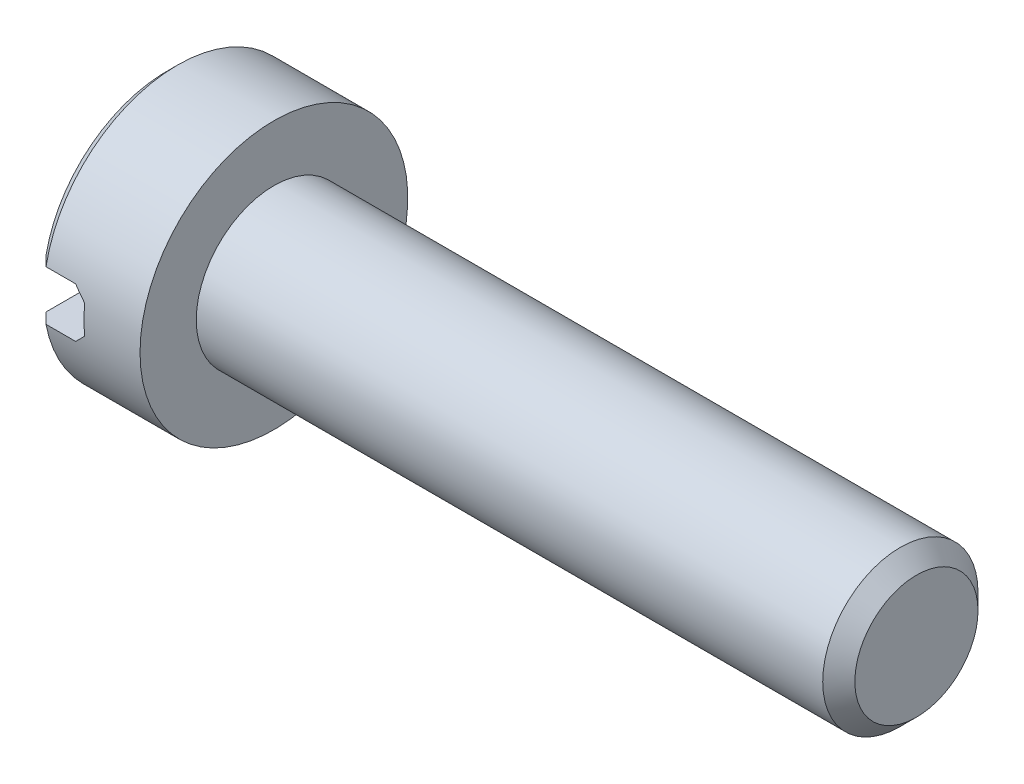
from build123d import *

# Parameters (mm, degrees)
ENL_V_MAT_EXTRU_1_DEPTH = 5
ESQUISSE3_R             = 1.45
EXTRUSION1_DEPTH        = 12
CHANFREIN1_SIZE         = 0.3


with BuildPart() as part:
    # Esquisse1 → R_volution1 (revolve)
    with BuildSketch(Plane.XY, mode=Mode.PRIVATE) as r_volution1_sk:
        Polygon((0, 0), (0, 2.3), (0.2, 2.5), (2, 2.5), (2, 0), align=None)
    revolve(r_volution1_sk.sketch.rotate(Axis((0, 0, 0), (1, 0, 0)), 90), axis=Axis((0, 0, 0), (1, 0, 0)))

    # Esquisse2 → Enl_v. mat.-Extru.1 (cut, symmetric)
    with BuildSketch(Plane.XY):
        Polygon((0, 0.465549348), (0.753445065, 0.465549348), (0.953445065, 0.265549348), (0.953445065, -0.265549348), (0.753445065, -0.465549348), (0, -0.465549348), align=None)
    extrude(amount=ENL_V_MAT_EXTRU_1_DEPTH, both=True, mode=Mode.SUBTRACT)

    # Esquisse3 → Extrusion1 (add)
    with BuildSketch(Plane(origin=(2, 0, 0), x_dir=(0, 0, -1), z_dir=(1, 0, 0))):
        with Locations(Location((0, 0, 0), (0, 0, 180))):
            Circle(ESQUISSE3_R)
    extrude(amount=EXTRUSION1_DEPTH)

    # Chanfrein1
    chanfrein1_edges = [part.edges().sort_by_distance(p)[0] for p in [
        (14, 0, -1.45),
    ]]
    chamfer(chanfrein1_edges, length=CHANFREIN1_SIZE)


solid = part.part
